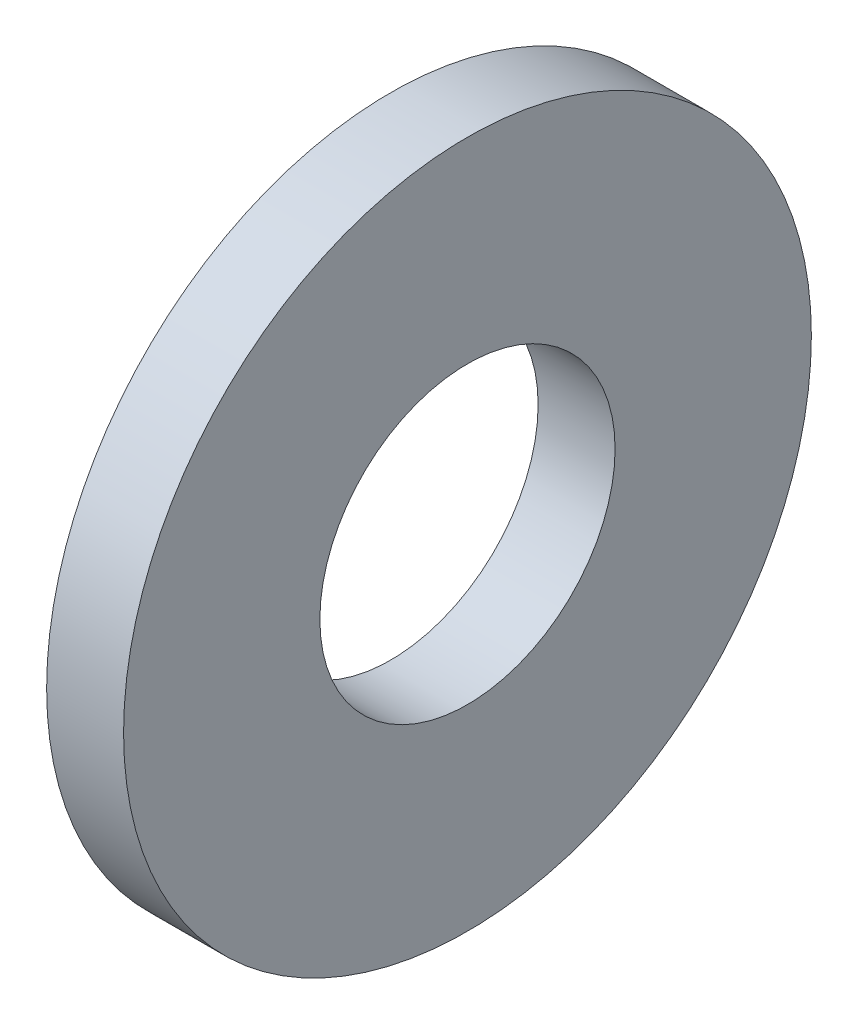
ISO-10303-21;
HEADER;
FILE_DESCRIPTION(('STEP AP214'),'2;1');
FILE_NAME('part.step','',(''),(''),'','','');
FILE_SCHEMA(('AUTOMOTIVE_DESIGN { 1 0 10303 214 1 1 1 1 }'));
ENDSEC;
DATA;
#1=APPLICATION_CONTEXT('core data for automotive mechanical design processes');
#2=APPLICATION_PROTOCOL_DEFINITION('international standard','automotive_design',2000,#1);
#3=PRODUCT_CONTEXT('',#1,'mechanical');
#4=PRODUCT('Part','Part','',(#3));
#5=PRODUCT_RELATED_PRODUCT_CATEGORY('part','',(#4));
#6=PRODUCT_DEFINITION_FORMATION('','',#4);
#7=PRODUCT_DEFINITION_CONTEXT('part definition',#1,'design');
#8=PRODUCT_DEFINITION('design','',#6,#7);
#9=PRODUCT_DEFINITION_SHAPE('','',#8);
#10=(LENGTH_UNIT() NAMED_UNIT(*) SI_UNIT(.MILLI.,.METRE.));
#11=(NAMED_UNIT(*) PLANE_ANGLE_UNIT() SI_UNIT($,.RADIAN.));
#12=(NAMED_UNIT(*) SI_UNIT($,.STERADIAN.) SOLID_ANGLE_UNIT());
#13=UNCERTAINTY_MEASURE_WITH_UNIT(LENGTH_MEASURE(1.E-05),#10,'distance_accuracy_value','');
#14=(GEOMETRIC_REPRESENTATION_CONTEXT(3) GLOBAL_UNCERTAINTY_ASSIGNED_CONTEXT((#13)) GLOBAL_UNIT_ASSIGNED_CONTEXT((#10,
#11,#12)) REPRESENTATION_CONTEXT('',''));
#15=CARTESIAN_POINT('',(0.,0.,0.));
#16=DIRECTION('',(0.,0.,1.));
#17=DIRECTION('',(1.,0.,0.));
#18=AXIS2_PLACEMENT_3D('',#15,#16,#17);
#19=CARTESIAN_POINT('',(-34.9249999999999,0.,0.));
#20=DIRECTION('',(-1.,0.,0.));
#21=DIRECTION('',(0.,0.,1.));
#22=AXIS2_PLACEMENT_3D('',#19,#20,#21);
#23=CYLINDRICAL_SURFACE('',#22,2.3876);
#24=CARTESIAN_POINT('',(0.,0.,0.));
#25=DIRECTION('',(-1.,0.,0.));
#26=DIRECTION('',(0.,0.,1.));
#27=AXIS2_PLACEMENT_3D('',#24,#25,#26);
#28=CIRCLE('',#27,2.3876);
#29=CARTESIAN_POINT('',(0.,0.,2.3876));
#30=VERTEX_POINT('',#29);
#31=EDGE_CURVE('E10',#30,#30,#28,.T.);
#32=ORIENTED_EDGE('',*,*,#31,.F.);
#33=EDGE_LOOP('',(#32));
#34=FACE_BOUND('',#33,.T.);
#35=CARTESIAN_POINT('',(-1.2446,0.,0.));
#36=DIRECTION('',(-1.,0.,0.));
#37=DIRECTION('',(0.,0.,1.));
#38=AXIS2_PLACEMENT_3D('',#35,#36,#37);
#39=CIRCLE('',#38,2.3876);
#40=CARTESIAN_POINT('',(-1.2446,0.,2.3876));
#41=VERTEX_POINT('',#40);
#42=EDGE_CURVE('E47',#41,#41,#39,.T.);
#43=ORIENTED_EDGE('',*,*,#42,.T.);
#44=EDGE_LOOP('',(#43));
#45=FACE_BOUND('',#44,.T.);
#46=ADVANCED_FACE('F33',(#34,#45),#23,.F.);
#47=CARTESIAN_POINT('',(0.,2.3876,0.));
#48=DIRECTION('',(-1.,0.,0.));
#49=DIRECTION('',(0.,0.,1.));
#50=AXIS2_PLACEMENT_3D('',#47,#48,#49);
#51=PLANE('',#50);
#52=CARTESIAN_POINT('',(0.,0.,0.));
#53=DIRECTION('',(-1.,0.,0.));
#54=DIRECTION('',(0.,0.,1.));
#55=AXIS2_PLACEMENT_3D('',#52,#53,#54);
#56=CIRCLE('',#55,5.5626);
#57=CARTESIAN_POINT('',(0.,0.,5.5626));
#58=VERTEX_POINT('',#57);
#59=EDGE_CURVE('E39',#58,#58,#56,.T.);
#60=ORIENTED_EDGE('',*,*,#59,.F.);
#61=EDGE_LOOP('',(#60));
#62=FACE_BOUND('',#61,.T.);
#63=ORIENTED_EDGE('',*,*,#31,.T.);
#64=EDGE_LOOP('',(#63));
#65=FACE_BOUND('',#64,.T.);
#66=ADVANCED_FACE('F62',(#62,#65),#51,.F.);
#67=CARTESIAN_POINT('',(-34.9249999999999,0.,0.));
#68=DIRECTION('',(-1.,0.,0.));
#69=DIRECTION('',(0.,0.,1.));
#70=AXIS2_PLACEMENT_3D('',#67,#68,#69);
#71=CYLINDRICAL_SURFACE('',#70,5.5626);
#72=CARTESIAN_POINT('',(-1.2446,0.,0.));
#73=DIRECTION('',(-1.,0.,0.));
#74=DIRECTION('',(0.,0.,1.));
#75=AXIS2_PLACEMENT_3D('',#72,#73,#74);
#76=CIRCLE('',#75,5.5626);
#77=CARTESIAN_POINT('',(-1.2446,0.,5.5626));
#78=VERTEX_POINT('',#77);
#79=EDGE_CURVE('E43',#78,#78,#76,.T.);
#80=ORIENTED_EDGE('',*,*,#79,.F.);
#81=EDGE_LOOP('',(#80));
#82=FACE_BOUND('',#81,.T.);
#83=ORIENTED_EDGE('',*,*,#59,.T.);
#84=EDGE_LOOP('',(#83));
#85=FACE_BOUND('',#84,.T.);
#86=ADVANCED_FACE('F57',(#82,#85),#71,.T.);
#87=CARTESIAN_POINT('',(-1.2446,5.5626,0.));
#88=DIRECTION('',(1.,0.,0.));
#89=DIRECTION('',(0.,0.,-1.));
#90=AXIS2_PLACEMENT_3D('',#87,#88,#89);
#91=PLANE('',#90);
#92=ORIENTED_EDGE('',*,*,#42,.F.);
#93=EDGE_LOOP('',(#92));
#94=FACE_BOUND('',#93,.T.);
#95=ORIENTED_EDGE('',*,*,#79,.T.);
#96=EDGE_LOOP('',(#95));
#97=FACE_BOUND('',#96,.T.);
#98=ADVANCED_FACE('F54',(#94,#97),#91,.F.);
#99=CLOSED_SHELL('',(#46,#66,#86,#98));
#100=MANIFOLD_SOLID_BREP('B2',#99);
#101=ADVANCED_BREP_SHAPE_REPRESENTATION('',(#18,#100),#14);
#102=SHAPE_DEFINITION_REPRESENTATION(#9,#101);
ENDSEC;
END-ISO-10303-21;
